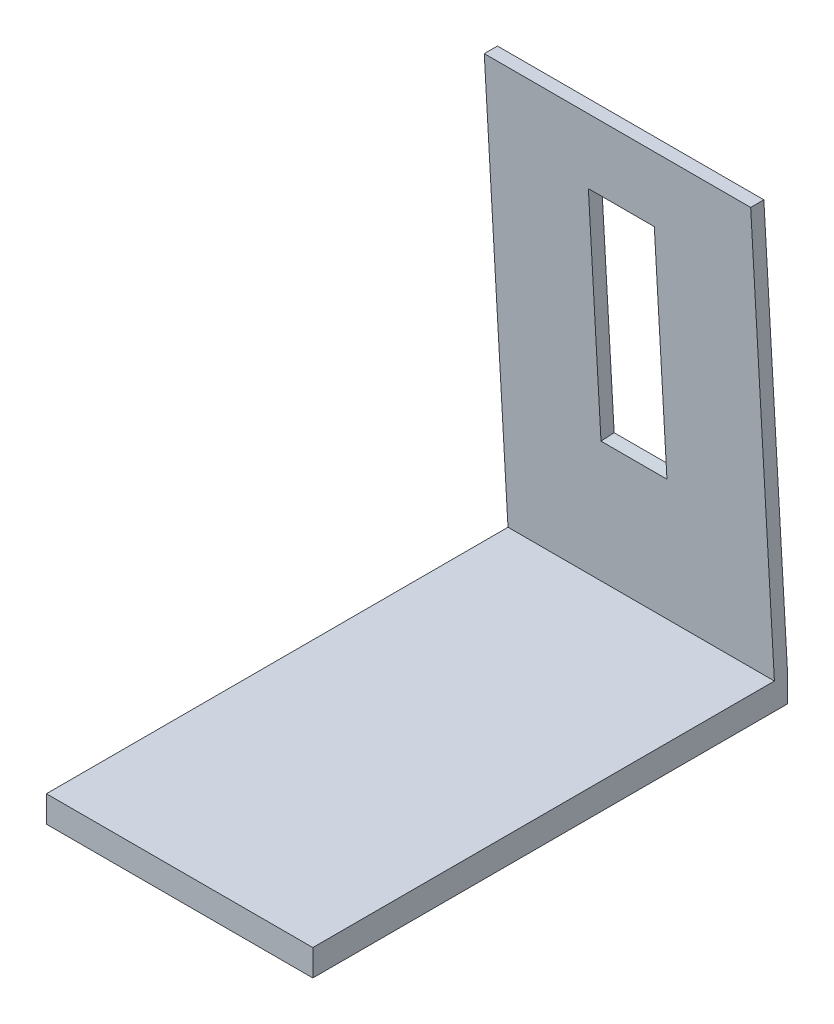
ISO-10303-21;
HEADER;
FILE_DESCRIPTION(('STEP AP214'),'2;1');
FILE_NAME('part.step','',(''),(''),'','','');
FILE_SCHEMA(('AUTOMOTIVE_DESIGN { 1 0 10303 214 1 1 1 1 }'));
ENDSEC;
DATA;
#1=APPLICATION_CONTEXT('core data for automotive mechanical design processes');
#2=APPLICATION_PROTOCOL_DEFINITION('international standard','automotive_design',2000,#1);
#3=PRODUCT_CONTEXT('',#1,'mechanical');
#4=PRODUCT('Part','Part','',(#3));
#5=PRODUCT_RELATED_PRODUCT_CATEGORY('part','',(#4));
#6=PRODUCT_DEFINITION_FORMATION('','',#4);
#7=PRODUCT_DEFINITION_CONTEXT('part definition',#1,'design');
#8=PRODUCT_DEFINITION('design','',#6,#7);
#9=PRODUCT_DEFINITION_SHAPE('','',#8);
#10=(LENGTH_UNIT() NAMED_UNIT(*) SI_UNIT(.MILLI.,.METRE.));
#11=(NAMED_UNIT(*) PLANE_ANGLE_UNIT() SI_UNIT($,.RADIAN.));
#12=(NAMED_UNIT(*) SI_UNIT($,.STERADIAN.) SOLID_ANGLE_UNIT());
#13=UNCERTAINTY_MEASURE_WITH_UNIT(LENGTH_MEASURE(1.E-05),#10,'distance_accuracy_value','');
#14=(GEOMETRIC_REPRESENTATION_CONTEXT(3) GLOBAL_UNCERTAINTY_ASSIGNED_CONTEXT((#13)) GLOBAL_UNIT_ASSIGNED_CONTEXT((#10,
#11,#12)) REPRESENTATION_CONTEXT('',''));
#15=CARTESIAN_POINT('',(0.,0.,0.));
#16=DIRECTION('',(0.,0.,1.));
#17=DIRECTION('',(1.,0.,0.));
#18=AXIS2_PLACEMENT_3D('',#15,#16,#17);
#19=CARTESIAN_POINT('',(-6.41350000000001,1.27,0.));
#20=DIRECTION('',(1.,0.,0.));
#21=DIRECTION('',(0.,0.,-1.));
#22=AXIS2_PLACEMENT_3D('',#19,#20,#21);
#23=PLANE('',#22);
#24=DIRECTION('',(0.,0.,1.));
#25=VECTOR('',#24,1.);
#26=CARTESIAN_POINT('',(-6.41350000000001,0.,0.));
#27=LINE('',#26,#25);
#28=CARTESIAN_POINT('',(-6.4135,0.,-22.86));
#29=VERTEX_POINT('',#28);
#30=CARTESIAN_POINT('',(-6.41350000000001,0.,0.));
#31=VERTEX_POINT('',#30);
#32=EDGE_CURVE('E161',#29,#31,#27,.T.);
#33=ORIENTED_EDGE('',*,*,#32,.T.);
#34=DIRECTION('',(0.,-1.,0.));
#35=VECTOR('',#34,1.);
#36=CARTESIAN_POINT('',(-6.41350000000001,1.27,0.));
#37=LINE('',#36,#35);
#38=CARTESIAN_POINT('',(-6.41350000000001,1.27,0.));
#39=VERTEX_POINT('',#38);
#40=EDGE_CURVE('E11',#39,#31,#37,.T.);
#41=ORIENTED_EDGE('',*,*,#40,.F.);
#42=DIRECTION('',(0.,0.,1.));
#43=VECTOR('',#42,1.);
#44=CARTESIAN_POINT('',(-6.41350000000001,1.27,0.));
#45=LINE('',#44,#43);
#46=CARTESIAN_POINT('',(-6.4135,1.27,-22.225));
#47=VERTEX_POINT('',#46);
#48=EDGE_CURVE('E187',#47,#39,#45,.T.);
#49=ORIENTED_EDGE('',*,*,#48,.F.);
#50=DIRECTION('',(0.,0.998421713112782,0.0561612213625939));
#51=VECTOR('',#50,1.);
#52=CARTESIAN_POINT('',(-6.4135,21.59,-21.082));
#53=LINE('',#52,#51);
#54=CARTESIAN_POINT('',(-6.4135,21.59,-21.082));
#55=VERTEX_POINT('',#54);
#56=EDGE_CURVE('E150',#47,#55,#53,.T.);
#57=ORIENTED_EDGE('',*,*,#56,.T.);
#58=DIRECTION('',(0.,0.,-1.));
#59=VECTOR('',#58,1.);
#60=CARTESIAN_POINT('',(-6.4135,21.59,-21.717));
#61=LINE('',#60,#59);
#62=CARTESIAN_POINT('',(-6.4135,21.59,-21.717));
#63=VERTEX_POINT('',#62);
#64=EDGE_CURVE('E146',#55,#63,#61,.T.);
#65=ORIENTED_EDGE('',*,*,#64,.T.);
#66=DIRECTION('',(0.,-0.998421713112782,-0.0561612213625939));
#67=VECTOR('',#66,1.);
#68=CARTESIAN_POINT('',(-6.4135,1.27,-22.86));
#69=LINE('',#68,#67);
#70=CARTESIAN_POINT('',(-6.4135,1.27,-22.86));
#71=VERTEX_POINT('',#70);
#72=EDGE_CURVE('E151',#63,#71,#69,.T.);
#73=ORIENTED_EDGE('',*,*,#72,.T.);
#74=DIRECTION('',(0.,-1.,0.));
#75=VECTOR('',#74,1.);
#76=CARTESIAN_POINT('',(-6.4135,1.27,-22.86));
#77=LINE('',#76,#75);
#78=EDGE_CURVE('E201',#71,#29,#77,.T.);
#79=ORIENTED_EDGE('',*,*,#78,.T.);
#80=EDGE_LOOP('',(#33,#41,#49,#57,#65,#73,#79));
#81=FACE_BOUND('',#80,.T.);
#82=ADVANCED_FACE('F32',(#81),#23,.F.);
#83=CARTESIAN_POINT('',(-6.41350000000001,1.27,0.));
#84=DIRECTION('',(0.,0.,-1.));
#85=DIRECTION('',(-1.,0.,0.));
#86=AXIS2_PLACEMENT_3D('',#83,#84,#85);
#87=PLANE('',#86);
#88=DIRECTION('',(1.,0.,0.));
#89=VECTOR('',#88,1.);
#90=CARTESIAN_POINT('',(-6.41350000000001,0.,0.));
#91=LINE('',#90,#89);
#92=CARTESIAN_POINT('',(6.41350000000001,0.,0.));
#93=VERTEX_POINT('',#92);
#94=EDGE_CURVE('E181',#31,#93,#91,.T.);
#95=ORIENTED_EDGE('',*,*,#94,.T.);
#96=DIRECTION('',(0.,-1.,0.));
#97=VECTOR('',#96,1.);
#98=CARTESIAN_POINT('',(6.41350000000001,1.27,0.));
#99=LINE('',#98,#97);
#100=CARTESIAN_POINT('',(6.41350000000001,1.27,0.));
#101=VERTEX_POINT('',#100);
#102=EDGE_CURVE('E40',#101,#93,#99,.T.);
#103=ORIENTED_EDGE('',*,*,#102,.F.);
#104=DIRECTION('',(1.,0.,0.));
#105=VECTOR('',#104,1.);
#106=CARTESIAN_POINT('',(-6.41350000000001,1.27,0.));
#107=LINE('',#106,#105);
#108=EDGE_CURVE('E190',#39,#101,#107,.T.);
#109=ORIENTED_EDGE('',*,*,#108,.F.);
#110=ORIENTED_EDGE('',*,*,#40,.T.);
#111=EDGE_LOOP('',(#95,#103,#109,#110));
#112=FACE_BOUND('',#111,.T.);
#113=ADVANCED_FACE('F233',(#112),#87,.F.);
#114=CARTESIAN_POINT('',(6.41350000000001,1.27,0.));
#115=DIRECTION('',(-1.,0.,0.));
#116=DIRECTION('',(0.,0.,1.));
#117=AXIS2_PLACEMENT_3D('',#114,#115,#116);
#118=PLANE('',#117);
#119=DIRECTION('',(0.,0.,-1.));
#120=VECTOR('',#119,1.);
#121=CARTESIAN_POINT('',(6.41350000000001,0.,0.));
#122=LINE('',#121,#120);
#123=CARTESIAN_POINT('',(6.4135,0.,-22.86));
#124=VERTEX_POINT('',#123);
#125=EDGE_CURVE('E183',#93,#124,#122,.T.);
#126=ORIENTED_EDGE('',*,*,#125,.T.);
#127=DIRECTION('',(0.,-1.,0.));
#128=VECTOR('',#127,1.);
#129=CARTESIAN_POINT('',(6.4135,1.27,-22.86));
#130=LINE('',#129,#128);
#131=CARTESIAN_POINT('',(6.4135,1.27,-22.86));
#132=VERTEX_POINT('',#131);
#133=EDGE_CURVE('E204',#132,#124,#130,.T.);
#134=ORIENTED_EDGE('',*,*,#133,.F.);
#135=DIRECTION('',(0.,-0.998421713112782,-0.0561612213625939));
#136=VECTOR('',#135,1.);
#137=CARTESIAN_POINT('',(6.4135,1.27,-22.86));
#138=LINE('',#137,#136);
#139=CARTESIAN_POINT('',(6.4135,21.59,-21.717));
#140=VERTEX_POINT('',#139);
#141=EDGE_CURVE('E158',#140,#132,#138,.T.);
#142=ORIENTED_EDGE('',*,*,#141,.F.);
#143=DIRECTION('',(0.,0.,-1.));
#144=VECTOR('',#143,1.);
#145=CARTESIAN_POINT('',(6.4135,21.59,-21.717));
#146=LINE('',#145,#144);
#147=CARTESIAN_POINT('',(6.4135,21.59,-21.082));
#148=VERTEX_POINT('',#147);
#149=EDGE_CURVE('E155',#148,#140,#146,.T.);
#150=ORIENTED_EDGE('',*,*,#149,.F.);
#151=DIRECTION('',(0.,0.998421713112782,0.0561612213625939));
#152=VECTOR('',#151,1.);
#153=CARTESIAN_POINT('',(6.4135,21.59,-21.082));
#154=LINE('',#153,#152);
#155=CARTESIAN_POINT('',(6.4135,1.27,-22.225));
#156=VERTEX_POINT('',#155);
#157=EDGE_CURVE('E159',#156,#148,#154,.T.);
#158=ORIENTED_EDGE('',*,*,#157,.F.);
#159=DIRECTION('',(0.,0.,-1.));
#160=VECTOR('',#159,1.);
#161=CARTESIAN_POINT('',(6.41350000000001,1.27,0.));
#162=LINE('',#161,#160);
#163=EDGE_CURVE('E195',#101,#156,#162,.T.);
#164=ORIENTED_EDGE('',*,*,#163,.F.);
#165=ORIENTED_EDGE('',*,*,#102,.T.);
#166=EDGE_LOOP('',(#126,#134,#142,#150,#158,#164,#165));
#167=FACE_BOUND('',#166,.T.);
#168=ADVANCED_FACE('F211',(#167),#118,.F.);
#169=CARTESIAN_POINT('',(-6.4135,1.27,-22.86));
#170=DIRECTION('',(0.,0.,1.));
#171=DIRECTION('',(1.,0.,0.));
#172=AXIS2_PLACEMENT_3D('',#169,#170,#171);
#173=PLANE('',#172);
#174=DIRECTION('',(-1.,0.,0.));
#175=VECTOR('',#174,1.);
#176=CARTESIAN_POINT('',(-6.4135,0.,-22.86));
#177=LINE('',#176,#175);
#178=EDGE_CURVE('E185',#124,#29,#177,.T.);
#179=ORIENTED_EDGE('',*,*,#178,.T.);
#180=ORIENTED_EDGE('',*,*,#78,.F.);
#181=DIRECTION('',(-1.,0.,0.));
#182=VECTOR('',#181,1.);
#183=CARTESIAN_POINT('',(-6.4135,1.27,-22.86));
#184=LINE('',#183,#182);
#185=EDGE_CURVE('E197',#132,#71,#184,.T.);
#186=ORIENTED_EDGE('',*,*,#185,.F.);
#187=ORIENTED_EDGE('',*,*,#133,.T.);
#188=EDGE_LOOP('',(#179,#180,#186,#187));
#189=FACE_BOUND('',#188,.T.);
#190=ADVANCED_FACE('F221',(#189),#173,.F.);
#191=CARTESIAN_POINT('',(-6.4135,1.27,-22.86));
#192=DIRECTION('',(0.,-1.,0.));
#193=DIRECTION('',(0.,0.,-1.));
#194=AXIS2_PLACEMENT_3D('',#191,#192,#193);
#195=PLANE('',#194);
#196=ORIENTED_EDGE('',*,*,#163,.T.);
#197=DIRECTION('',(-1.,0.,0.));
#198=VECTOR('',#197,1.);
#199=CARTESIAN_POINT('',(26.8111391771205,1.27,-22.225));
#200=LINE('',#199,#198);
#201=EDGE_CURVE('E154',#156,#47,#200,.T.);
#202=ORIENTED_EDGE('',*,*,#201,.T.);
#203=ORIENTED_EDGE('',*,*,#48,.T.);
#204=ORIENTED_EDGE('',*,*,#108,.T.);
#205=EDGE_LOOP('',(#196,#202,#203,#204));
#206=FACE_BOUND('',#205,.T.);
#207=ADVANCED_FACE('F232',(#206),#195,.F.);
#208=CARTESIAN_POINT('',(-6.4135,0.,-22.86));
#209=DIRECTION('',(0.,-1.,0.));
#210=DIRECTION('',(0.,0.,-1.));
#211=AXIS2_PLACEMENT_3D('',#208,#209,#210);
#212=PLANE('',#211);
#213=ORIENTED_EDGE('',*,*,#32,.F.);
#214=ORIENTED_EDGE('',*,*,#178,.F.);
#215=ORIENTED_EDGE('',*,*,#125,.F.);
#216=ORIENTED_EDGE('',*,*,#94,.F.);
#217=EDGE_LOOP('',(#213,#214,#215,#216));
#218=FACE_BOUND('',#217,.T.);
#219=ADVANCED_FACE('F218',(#218),#212,.T.);
#220=CARTESIAN_POINT('',(26.8111391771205,21.59,-21.082));
#221=DIRECTION('',(0.,0.0561612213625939,-0.998421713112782));
#222=DIRECTION('',(0.,0.998421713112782,0.0561612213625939));
#223=AXIS2_PLACEMENT_3D('',#220,#221,#222);
#224=PLANE('',#223);
#225=DIRECTION('',(1.,0.,0.));
#226=VECTOR('',#225,1.);
#227=CARTESIAN_POINT('',(-1.5875,7.44632514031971,-21.877581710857));
#228=LINE('',#227,#226);
#229=CARTESIAN_POINT('',(-1.5875,7.44632514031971,-21.877581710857));
#230=VERTEX_POINT('',#229);
#231=CARTESIAN_POINT('',(1.5875,7.44632514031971,-21.877581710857));
#232=VERTEX_POINT('',#231);
#233=EDGE_CURVE('E268',#230,#232,#228,.T.);
#234=ORIENTED_EDGE('',*,*,#233,.F.);
#235=DIRECTION('',(0.,-0.998421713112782,-0.0561612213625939));
#236=VECTOR('',#235,1.);
#237=CARTESIAN_POINT('',(-1.5875,7.44632514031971,-21.877581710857));
#238=LINE('',#237,#236);
#239=CARTESIAN_POINT('',(-1.5875,18.2820145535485,-21.2680741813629));
#240=VERTEX_POINT('',#239);
#241=EDGE_CURVE('E147',#240,#230,#238,.T.);
#242=ORIENTED_EDGE('',*,*,#241,.F.);
#243=DIRECTION('',(-1.,0.,0.));
#244=VECTOR('',#243,1.);
#245=CARTESIAN_POINT('',(-1.5875,18.2820145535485,-21.2680741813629));
#246=LINE('',#245,#244);
#247=CARTESIAN_POINT('',(1.5875,18.2820145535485,-21.2680741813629));
#248=VERTEX_POINT('',#247);
#249=EDGE_CURVE('E144',#248,#240,#246,.T.);
#250=ORIENTED_EDGE('',*,*,#249,.F.);
#251=DIRECTION('',(0.,0.998421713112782,0.0561612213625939));
#252=VECTOR('',#251,1.);
#253=CARTESIAN_POINT('',(1.5875,7.44632514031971,-21.877581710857));
#254=LINE('',#253,#252);
#255=EDGE_CURVE('E122',#232,#248,#254,.T.);
#256=ORIENTED_EDGE('',*,*,#255,.F.);
#257=EDGE_LOOP('',(#234,#242,#250,#256));
#258=FACE_BOUND('',#257,.T.);
#259=ORIENTED_EDGE('',*,*,#201,.F.);
#260=ORIENTED_EDGE('',*,*,#157,.T.);
#261=DIRECTION('',(-1.,0.,0.));
#262=VECTOR('',#261,1.);
#263=CARTESIAN_POINT('',(26.8111391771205,21.59,-21.082));
#264=LINE('',#263,#262);
#265=EDGE_CURVE('E164',#148,#55,#264,.T.);
#266=ORIENTED_EDGE('',*,*,#265,.T.);
#267=ORIENTED_EDGE('',*,*,#56,.F.);
#268=EDGE_LOOP('',(#259,#260,#266,#267));
#269=FACE_BOUND('',#268,.T.);
#270=ADVANCED_FACE('F229',(#258,#269),#224,.F.);
#271=CARTESIAN_POINT('',(26.8111391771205,21.59,-21.717));
#272=DIRECTION('',(0.,-1.,0.));
#273=DIRECTION('',(0.,0.,-1.));
#274=AXIS2_PLACEMENT_3D('',#271,#272,#273);
#275=PLANE('',#274);
#276=ORIENTED_EDGE('',*,*,#265,.F.);
#277=ORIENTED_EDGE('',*,*,#149,.T.);
#278=DIRECTION('',(-1.,0.,0.));
#279=VECTOR('',#278,1.);
#280=CARTESIAN_POINT('',(26.8111391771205,21.59,-21.717));
#281=LINE('',#280,#279);
#282=EDGE_CURVE('E172',#140,#63,#281,.T.);
#283=ORIENTED_EDGE('',*,*,#282,.T.);
#284=ORIENTED_EDGE('',*,*,#64,.F.);
#285=EDGE_LOOP('',(#276,#277,#283,#284));
#286=FACE_BOUND('',#285,.T.);
#287=ADVANCED_FACE('F228',(#286),#275,.F.);
#288=CARTESIAN_POINT('',(26.8111391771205,1.27,-22.86));
#289=DIRECTION('',(0.,-0.0561612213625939,0.998421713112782));
#290=DIRECTION('',(0.,-0.998421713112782,-0.0561612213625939));
#291=AXIS2_PLACEMENT_3D('',#288,#289,#290);
#292=PLANE('',#291);
#293=DIRECTION('',(1.,0.,0.));
#294=VECTOR('',#293,1.);
#295=CARTESIAN_POINT('',(-1.5875,18.317620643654,-21.9010713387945));
#296=LINE('',#295,#294);
#297=CARTESIAN_POINT('',(-1.5875,18.317620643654,-21.9010713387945));
#298=VERTEX_POINT('',#297);
#299=CARTESIAN_POINT('',(1.5875,18.317620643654,-21.9010713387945));
#300=VERTEX_POINT('',#299);
#301=EDGE_CURVE('E128',#298,#300,#296,.T.);
#302=ORIENTED_EDGE('',*,*,#301,.F.);
#303=DIRECTION('',(0.,0.998421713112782,0.0561612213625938));
#304=VECTOR('',#303,1.);
#305=CARTESIAN_POINT('',(-1.5875,7.48193123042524,-22.5105788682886));
#306=LINE('',#305,#304);
#307=CARTESIAN_POINT('',(-1.5875,7.48193123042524,-22.5105788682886));
#308=VERTEX_POINT('',#307);
#309=EDGE_CURVE('E56',#308,#298,#306,.T.);
#310=ORIENTED_EDGE('',*,*,#309,.F.);
#311=DIRECTION('',(-1.,0.,0.));
#312=VECTOR('',#311,1.);
#313=CARTESIAN_POINT('',(-1.5875,7.48193123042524,-22.5105788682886));
#314=LINE('',#313,#312);
#315=CARTESIAN_POINT('',(1.5875,7.48193123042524,-22.5105788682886));
#316=VERTEX_POINT('',#315);
#317=EDGE_CURVE('E135',#316,#308,#314,.T.);
#318=ORIENTED_EDGE('',*,*,#317,.F.);
#319=DIRECTION('',(0.,-0.998421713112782,-0.0561612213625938));
#320=VECTOR('',#319,1.);
#321=CARTESIAN_POINT('',(1.5875,7.48193123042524,-22.5105788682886));
#322=LINE('',#321,#320);
#323=EDGE_CURVE('E119',#300,#316,#322,.T.);
#324=ORIENTED_EDGE('',*,*,#323,.F.);
#325=EDGE_LOOP('',(#302,#310,#318,#324));
#326=FACE_BOUND('',#325,.T.);
#327=ORIENTED_EDGE('',*,*,#282,.F.);
#328=ORIENTED_EDGE('',*,*,#141,.T.);
#329=ORIENTED_EDGE('',*,*,#185,.T.);
#330=ORIENTED_EDGE('',*,*,#72,.F.);
#331=EDGE_LOOP('',(#327,#328,#329,#330));
#332=FACE_BOUND('',#331,.T.);
#333=ADVANCED_FACE('F132',(#326,#332),#292,.F.);
#334=CARTESIAN_POINT('',(-1.5875,6.81127037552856,-10.587719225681));
#335=DIRECTION('',(-1.,0.,0.));
#336=DIRECTION('',(0.,-1.,0.));
#337=AXIS2_PLACEMENT_3D('',#334,#335,#336);
#338=PLANE('',#337);
#339=ORIENTED_EDGE('',*,*,#241,.T.);
#340=DIRECTION('',(0.,0.0561612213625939,-0.998421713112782));
#341=VECTOR('',#340,1.);
#342=CARTESIAN_POINT('',(-1.5875,6.81127037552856,-10.587719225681));
#343=LINE('',#342,#341);
#344=EDGE_CURVE('E140',#230,#308,#343,.T.);
#345=ORIENTED_EDGE('',*,*,#344,.T.);
#346=ORIENTED_EDGE('',*,*,#309,.T.);
#347=DIRECTION('',(0.,0.0561612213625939,-0.998421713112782));
#348=VECTOR('',#347,1.);
#349=CARTESIAN_POINT('',(-1.5875,17.6469597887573,-9.9782116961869));
#350=LINE('',#349,#348);
#351=EDGE_CURVE('E125',#240,#298,#350,.T.);
#352=ORIENTED_EDGE('',*,*,#351,.F.);
#353=EDGE_LOOP('',(#339,#345,#346,#352));
#354=FACE_BOUND('',#353,.T.);
#355=ADVANCED_FACE('F249',(#354),#338,.F.);
#356=CARTESIAN_POINT('',(-1.5875,6.81127037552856,-10.587719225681));
#357=DIRECTION('',(0.,-0.998421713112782,-0.0561612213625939));
#358=DIRECTION('',(0.,0.0561612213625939,-0.998421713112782));
#359=AXIS2_PLACEMENT_3D('',#356,#357,#358);
#360=PLANE('',#359);
#361=ORIENTED_EDGE('',*,*,#233,.T.);
#362=DIRECTION('',(0.,0.0561612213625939,-0.998421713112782));
#363=VECTOR('',#362,1.);
#364=CARTESIAN_POINT('',(1.5875,6.81127037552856,-10.587719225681));
#365=LINE('',#364,#363);
#366=EDGE_CURVE('E124',#232,#316,#365,.T.);
#367=ORIENTED_EDGE('',*,*,#366,.T.);
#368=ORIENTED_EDGE('',*,*,#317,.T.);
#369=ORIENTED_EDGE('',*,*,#344,.F.);
#370=EDGE_LOOP('',(#361,#367,#368,#369));
#371=FACE_BOUND('',#370,.T.);
#372=ADVANCED_FACE('F257',(#371),#360,.F.);
#373=CARTESIAN_POINT('',(1.5875,6.81127037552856,-10.587719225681));
#374=DIRECTION('',(1.,0.,0.));
#375=DIRECTION('',(0.,1.,0.));
#376=AXIS2_PLACEMENT_3D('',#373,#374,#375);
#377=PLANE('',#376);
#378=ORIENTED_EDGE('',*,*,#255,.T.);
#379=DIRECTION('',(0.,0.0561612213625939,-0.998421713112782));
#380=VECTOR('',#379,1.);
#381=CARTESIAN_POINT('',(1.5875,17.6469597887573,-9.9782116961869));
#382=LINE('',#381,#380);
#383=EDGE_CURVE('E48',#248,#300,#382,.T.);
#384=ORIENTED_EDGE('',*,*,#383,.T.);
#385=ORIENTED_EDGE('',*,*,#323,.T.);
#386=ORIENTED_EDGE('',*,*,#366,.F.);
#387=EDGE_LOOP('',(#378,#384,#385,#386));
#388=FACE_BOUND('',#387,.T.);
#389=ADVANCED_FACE('F116',(#388),#377,.F.);
#390=CARTESIAN_POINT('',(-1.5875,17.6469597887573,-9.9782116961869));
#391=DIRECTION('',(0.,0.998421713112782,0.0561612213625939));
#392=DIRECTION('',(0.,-0.0561612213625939,0.998421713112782));
#393=AXIS2_PLACEMENT_3D('',#390,#391,#392);
#394=PLANE('',#393);
#395=ORIENTED_EDGE('',*,*,#249,.T.);
#396=ORIENTED_EDGE('',*,*,#351,.T.);
#397=ORIENTED_EDGE('',*,*,#301,.T.);
#398=ORIENTED_EDGE('',*,*,#383,.F.);
#399=EDGE_LOOP('',(#395,#396,#397,#398));
#400=FACE_BOUND('',#399,.T.);
#401=ADVANCED_FACE('F129',(#400),#394,.F.);
#402=CLOSED_SHELL('',(#82,#113,#168,#190,#207,#219,#270,#287,#333,#355,#372,#389,#401));
#403=MANIFOLD_SOLID_BREP('B2',#402);
#404=ADVANCED_BREP_SHAPE_REPRESENTATION('',(#18,#403),#14);
#405=SHAPE_DEFINITION_REPRESENTATION(#9,#404);
ENDSEC;
END-ISO-10303-21;
